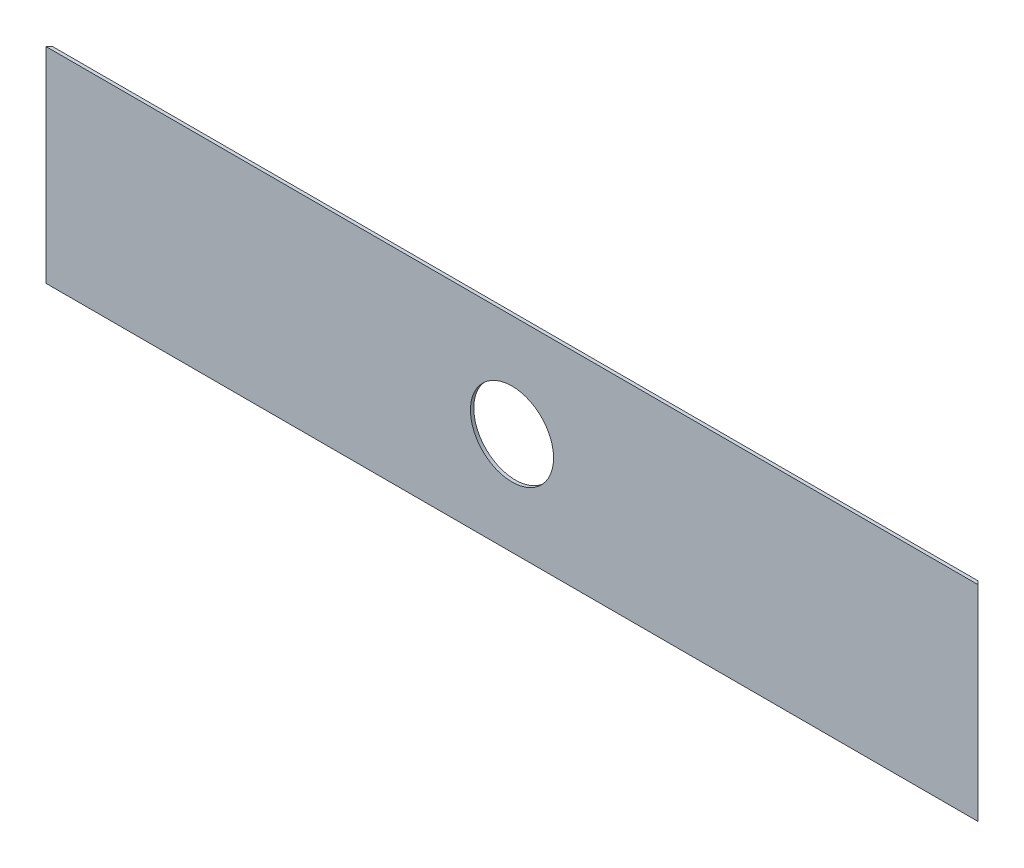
ISO-10303-21;
HEADER;
FILE_DESCRIPTION(('STEP AP214'),'2;1');
FILE_NAME('part.step','',(''),(''),'','','');
FILE_SCHEMA(('AUTOMOTIVE_DESIGN { 1 0 10303 214 1 1 1 1 }'));
ENDSEC;
DATA;
#1=APPLICATION_CONTEXT('core data for automotive mechanical design processes');
#2=APPLICATION_PROTOCOL_DEFINITION('international standard','automotive_design',2000,#1);
#3=PRODUCT_CONTEXT('',#1,'mechanical');
#4=PRODUCT('Part','Part','',(#3));
#5=PRODUCT_RELATED_PRODUCT_CATEGORY('part','',(#4));
#6=PRODUCT_DEFINITION_FORMATION('','',#4);
#7=PRODUCT_DEFINITION_CONTEXT('part definition',#1,'design');
#8=PRODUCT_DEFINITION('design','',#6,#7);
#9=PRODUCT_DEFINITION_SHAPE('','',#8);
#10=(LENGTH_UNIT() NAMED_UNIT(*) SI_UNIT(.MILLI.,.METRE.));
#11=(NAMED_UNIT(*) PLANE_ANGLE_UNIT() SI_UNIT($,.RADIAN.));
#12=(NAMED_UNIT(*) SI_UNIT($,.STERADIAN.) SOLID_ANGLE_UNIT());
#13=UNCERTAINTY_MEASURE_WITH_UNIT(LENGTH_MEASURE(1.E-05),#10,'distance_accuracy_value','');
#14=(GEOMETRIC_REPRESENTATION_CONTEXT(3) GLOBAL_UNCERTAINTY_ASSIGNED_CONTEXT((#13)) GLOBAL_UNIT_ASSIGNED_CONTEXT((#10,
#11,#12)) REPRESENTATION_CONTEXT('',''));
#15=CARTESIAN_POINT('',(0.,0.,0.));
#16=DIRECTION('',(0.,0.,1.));
#17=DIRECTION('',(1.,0.,0.));
#18=AXIS2_PLACEMENT_3D('',#15,#16,#17);
#19=CARTESIAN_POINT('',(0.,185.0772745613,16.));
#20=DIRECTION('',(0.,0.,1.));
#21=DIRECTION('',(1.,0.,0.));
#22=AXIS2_PLACEMENT_3D('',#19,#20,#21);
#23=PLANE('',#22);
#24=CARTESIAN_POINT('',(0.,185.0772745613,16.));
#25=DIRECTION('',(0.,0.,1.));
#26=DIRECTION('',(1.,0.,0.));
#27=AXIS2_PLACEMENT_3D('',#24,#25,#26);
#28=CIRCLE('',#27,75.);
#29=CARTESIAN_POINT('',(75.,185.0772745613,16.));
#30=VERTEX_POINT('',#29);
#31=EDGE_CURVE('E10',#30,#30,#28,.T.);
#32=ORIENTED_EDGE('',*,*,#31,.F.);
#33=EDGE_LOOP('',(#32));
#34=FACE_BOUND('',#33,.T.);
#35=DIRECTION('',(1.,0.,0.));
#36=VECTOR('',#35,1.);
#37=CARTESIAN_POINT('',(-841.,0.,16.));
#38=LINE('',#37,#36);
#39=CARTESIAN_POINT('',(-841.,0.,16.));
#40=VERTEX_POINT('',#39);
#41=CARTESIAN_POINT('',(841.,0.,16.));
#42=VERTEX_POINT('',#41);
#43=EDGE_CURVE('E75',#40,#42,#38,.T.);
#44=ORIENTED_EDGE('',*,*,#43,.T.);
#45=DIRECTION('',(0.,1.,0.));
#46=VECTOR('',#45,1.);
#47=CARTESIAN_POINT('',(841.,0.,16.));
#48=LINE('',#47,#46);
#49=CARTESIAN_POINT('',(841.,370.15454912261,16.));
#50=VERTEX_POINT('',#49);
#51=EDGE_CURVE('E62',#42,#50,#48,.T.);
#52=ORIENTED_EDGE('',*,*,#51,.T.);
#53=DIRECTION('',(-1.,0.,0.));
#54=VECTOR('',#53,1.);
#55=CARTESIAN_POINT('',(841.,370.15454912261,16.));
#56=LINE('',#55,#54);
#57=CARTESIAN_POINT('',(-841.,370.15454912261,16.));
#58=VERTEX_POINT('',#57);
#59=EDGE_CURVE('E82',#50,#58,#56,.T.);
#60=ORIENTED_EDGE('',*,*,#59,.T.);
#61=DIRECTION('',(0.,-1.,0.));
#62=VECTOR('',#61,1.);
#63=CARTESIAN_POINT('',(-841.,370.15454912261,16.));
#64=LINE('',#63,#62);
#65=EDGE_CURVE('E77',#58,#40,#64,.T.);
#66=ORIENTED_EDGE('',*,*,#65,.T.);
#67=EDGE_LOOP('',(#44,#52,#60,#66));
#68=FACE_BOUND('',#67,.T.);
#69=ADVANCED_FACE('F16',(#34,#68),#23,.T.);
#70=CARTESIAN_POINT('',(0.,185.0772745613,9.));
#71=DIRECTION('',(0.,0.,1.));
#72=DIRECTION('',(1.,0.,0.));
#73=AXIS2_PLACEMENT_3D('',#70,#71,#72);
#74=CYLINDRICAL_SURFACE('',#73,75.);
#75=DIRECTION('',(0.,0.,1.));
#76=VECTOR('',#75,1.);
#77=CARTESIAN_POINT('',(75.,185.0772745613,9.));
#78=LINE('',#77,#76);
#79=CARTESIAN_POINT('',(75.,185.0772745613,10.));
#80=VERTEX_POINT('',#79);
#81=EDGE_CURVE('E19',#80,#30,#78,.T.);
#82=ORIENTED_EDGE('',*,*,#81,.F.);
#83=CARTESIAN_POINT('',(0.,185.0772745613,10.));
#84=DIRECTION('',(0.,0.,1.));
#85=DIRECTION('',(1.,0.,0.));
#86=AXIS2_PLACEMENT_3D('',#83,#84,#85);
#87=CIRCLE('',#86,75.);
#88=EDGE_CURVE('E109',#80,#80,#87,.T.);
#89=ORIENTED_EDGE('',*,*,#88,.F.);
#90=ORIENTED_EDGE('',*,*,#81,.T.);
#91=ORIENTED_EDGE('',*,*,#31,.T.);
#92=EDGE_LOOP('',(#82,#89,#90,#91));
#93=FACE_BOUND('',#92,.T.);
#94=ADVANCED_FACE('F153',(#93),#74,.F.);
#95=CARTESIAN_POINT('',(838.,185.0772745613,13.));
#96=DIRECTION('',(0.707106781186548,0.,-0.707106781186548));
#97=DIRECTION('',(0.,-1.,0.));
#98=AXIS2_PLACEMENT_3D('',#95,#96,#97);
#99=PLANE('',#98);
#100=DIRECTION('',(0.,-1.,0.));
#101=VECTOR('',#100,1.);
#102=CARTESIAN_POINT('',(835.,370.15454912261,10.));
#103=LINE('',#102,#101);
#104=CARTESIAN_POINT('',(835.,370.15454912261,10.));
#105=VERTEX_POINT('',#104);
#106=CARTESIAN_POINT('',(835.,0.,10.));
#107=VERTEX_POINT('',#106);
#108=EDGE_CURVE('E128',#105,#107,#103,.T.);
#109=ORIENTED_EDGE('',*,*,#108,.F.);
#110=DIRECTION('',(0.707106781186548,0.,0.707106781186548));
#111=VECTOR('',#110,1.);
#112=CARTESIAN_POINT('',(835.,370.15454912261,10.));
#113=LINE('',#112,#111);
#114=EDGE_CURVE('E70',#105,#50,#113,.T.);
#115=ORIENTED_EDGE('',*,*,#114,.T.);
#116=ORIENTED_EDGE('',*,*,#51,.F.);
#117=DIRECTION('',(0.707106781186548,0.,0.707106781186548));
#118=VECTOR('',#117,1.);
#119=CARTESIAN_POINT('',(835.,0.,10.));
#120=LINE('',#119,#118);
#121=EDGE_CURVE('E67',#107,#42,#120,.T.);
#122=ORIENTED_EDGE('',*,*,#121,.F.);
#123=EDGE_LOOP('',(#109,#115,#116,#122));
#124=FACE_BOUND('',#123,.T.);
#125=ADVANCED_FACE('F65',(#124),#99,.T.);
#126=CARTESIAN_POINT('',(0.,370.15454912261,13.01068575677));
#127=DIRECTION('',(0.,1.,0.));
#128=DIRECTION('',(1.,0.,0.));
#129=AXIS2_PLACEMENT_3D('',#126,#127,#128);
#130=PLANE('',#129);
#131=DIRECTION('',(1.,0.,0.));
#132=VECTOR('',#131,1.);
#133=CARTESIAN_POINT('',(-835.,370.15454912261,10.));
#134=LINE('',#133,#132);
#135=CARTESIAN_POINT('',(-835.,370.15454912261,10.));
#136=VERTEX_POINT('',#135);
#137=EDGE_CURVE('E133',#136,#105,#134,.T.);
#138=ORIENTED_EDGE('',*,*,#137,.F.);
#139=DIRECTION('',(-0.707106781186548,0.,0.707106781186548));
#140=VECTOR('',#139,1.);
#141=CARTESIAN_POINT('',(-835.,370.15454912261,10.));
#142=LINE('',#141,#140);
#143=EDGE_CURVE('E89',#136,#58,#142,.T.);
#144=ORIENTED_EDGE('',*,*,#143,.T.);
#145=ORIENTED_EDGE('',*,*,#59,.F.);
#146=ORIENTED_EDGE('',*,*,#114,.F.);
#147=EDGE_LOOP('',(#138,#144,#145,#146));
#148=FACE_BOUND('',#147,.T.);
#149=ADVANCED_FACE('F143',(#148),#130,.T.);
#150=CARTESIAN_POINT('',(0.,0.,13.01068575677));
#151=DIRECTION('',(0.,-1.,0.));
#152=DIRECTION('',(0.,0.,-1.));
#153=AXIS2_PLACEMENT_3D('',#150,#151,#152);
#154=PLANE('',#153);
#155=DIRECTION('',(-1.,0.,0.));
#156=VECTOR('',#155,1.);
#157=CARTESIAN_POINT('',(835.,0.,10.));
#158=LINE('',#157,#156);
#159=CARTESIAN_POINT('',(-835.,0.,10.));
#160=VERTEX_POINT('',#159);
#161=EDGE_CURVE('E86',#107,#160,#158,.T.);
#162=ORIENTED_EDGE('',*,*,#161,.F.);
#163=ORIENTED_EDGE('',*,*,#121,.T.);
#164=ORIENTED_EDGE('',*,*,#43,.F.);
#165=DIRECTION('',(0.707106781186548,0.,-0.707106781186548));
#166=VECTOR('',#165,1.);
#167=CARTESIAN_POINT('',(-841.,0.,16.));
#168=LINE('',#167,#166);
#169=EDGE_CURVE('E111',#40,#160,#168,.T.);
#170=ORIENTED_EDGE('',*,*,#169,.T.);
#171=EDGE_LOOP('',(#162,#163,#164,#170));
#172=FACE_BOUND('',#171,.T.);
#173=ADVANCED_FACE('F84',(#172),#154,.T.);
#174=CARTESIAN_POINT('',(-838.,185.0772745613,13.));
#175=DIRECTION('',(-0.707106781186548,0.,-0.707106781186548));
#176=DIRECTION('',(-0.707106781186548,0.,0.707106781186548));
#177=AXIS2_PLACEMENT_3D('',#174,#175,#176);
#178=PLANE('',#177);
#179=DIRECTION('',(0.,1.,0.));
#180=VECTOR('',#179,1.);
#181=CARTESIAN_POINT('',(-835.,0.,10.));
#182=LINE('',#181,#180);
#183=EDGE_CURVE('E127',#160,#136,#182,.T.);
#184=ORIENTED_EDGE('',*,*,#183,.F.);
#185=ORIENTED_EDGE('',*,*,#169,.F.);
#186=ORIENTED_EDGE('',*,*,#65,.F.);
#187=ORIENTED_EDGE('',*,*,#143,.F.);
#188=EDGE_LOOP('',(#184,#185,#186,#187));
#189=FACE_BOUND('',#188,.T.);
#190=ADVANCED_FACE('F130',(#189),#178,.T.);
#191=CARTESIAN_POINT('',(0.,185.0772745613,10.));
#192=DIRECTION('',(0.,0.,-1.));
#193=DIRECTION('',(0.,-1.,0.));
#194=AXIS2_PLACEMENT_3D('',#191,#192,#193);
#195=PLANE('',#194);
#196=ORIENTED_EDGE('',*,*,#88,.T.);
#197=EDGE_LOOP('',(#196));
#198=FACE_BOUND('',#197,.T.);
#199=ORIENTED_EDGE('',*,*,#183,.T.);
#200=ORIENTED_EDGE('',*,*,#137,.T.);
#201=ORIENTED_EDGE('',*,*,#108,.T.);
#202=ORIENTED_EDGE('',*,*,#161,.T.);
#203=EDGE_LOOP('',(#199,#200,#201,#202));
#204=FACE_BOUND('',#203,.T.);
#205=ADVANCED_FACE('F125',(#198,#204),#195,.T.);
#206=CLOSED_SHELL('',(#69,#94,#125,#149,#173,#190,#205));
#207=MANIFOLD_SOLID_BREP('B1',#206);
#208=ADVANCED_BREP_SHAPE_REPRESENTATION('',(#18,#207),#14);
#209=SHAPE_DEFINITION_REPRESENTATION(#9,#208);
ENDSEC;
END-ISO-10303-21;
